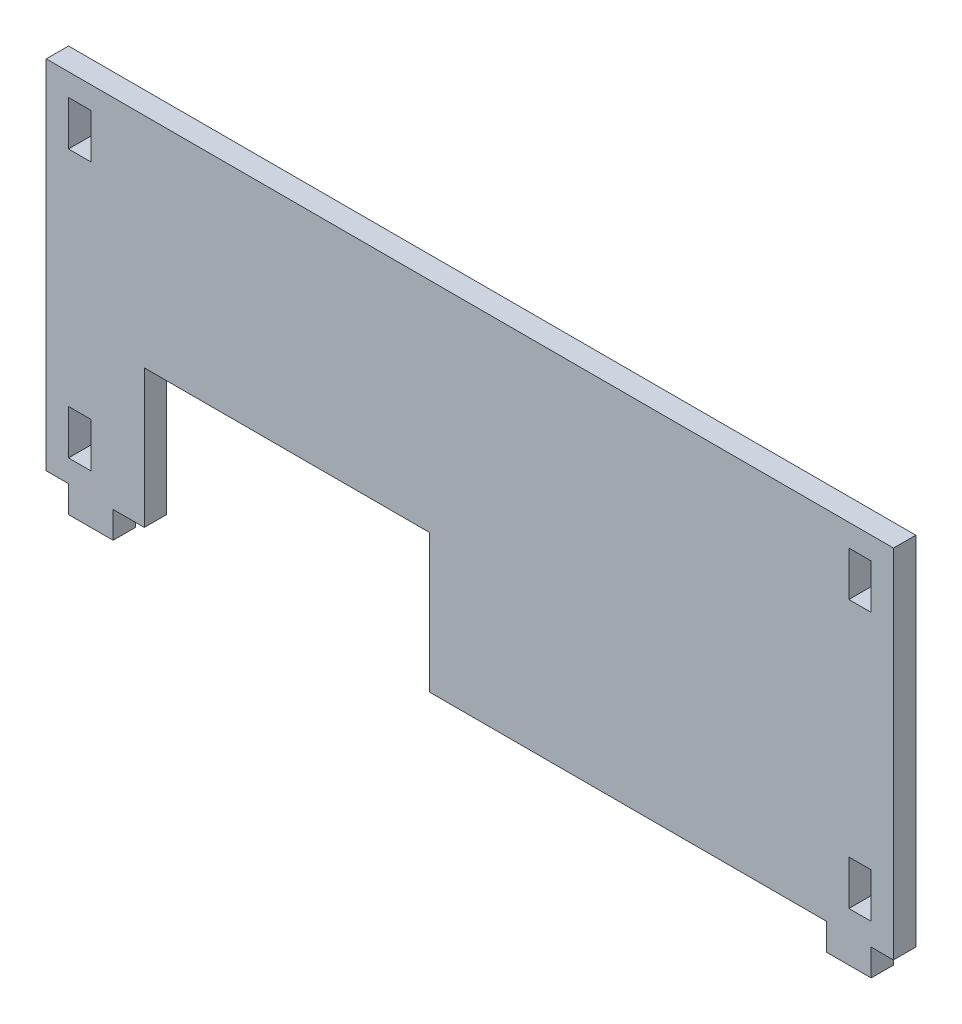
from build123d import *

# Parameters (mm, degrees)
SKETCH1_W           = 3.175
SKETCH1_H           = 6.35
BOSS_EXTRUDE1_DEPTH = 3.175


with BuildPart() as part:
    # Sketch1 → Boss-Extrude1 (new body)
    with BuildSketch(Plane.XY):
        Polygon((0, 0), (3.175, 0), (3.175, -3.81), (9.525, -3.81), (9.525, 0), (13.97, 0), (13.97, 19.685), (54.61, 19.685), (54.61, 0), (111.125, 0), (111.125, -3.81), (117.475, -3.81), (117.475, 0), (120.65, 0), (120.65, 50.8), (0, 50.8), align=None)
        with Locations((4.7625, 44.45)):
            Rectangle(SKETCH1_W, SKETCH1_H, mode=Mode.SUBTRACT)
        with Locations((4.7625, 6.35)):
            Rectangle(SKETCH1_W, SKETCH1_H, mode=Mode.SUBTRACT)
        with Locations((115.8875, 6.35)):
            Rectangle(SKETCH1_W, SKETCH1_H, mode=Mode.SUBTRACT)
        with Locations((115.8875, 44.45)):
            Rectangle(SKETCH1_W, SKETCH1_H, mode=Mode.SUBTRACT)
    extrude(amount=BOSS_EXTRUDE1_DEPTH)


solid = part.part
